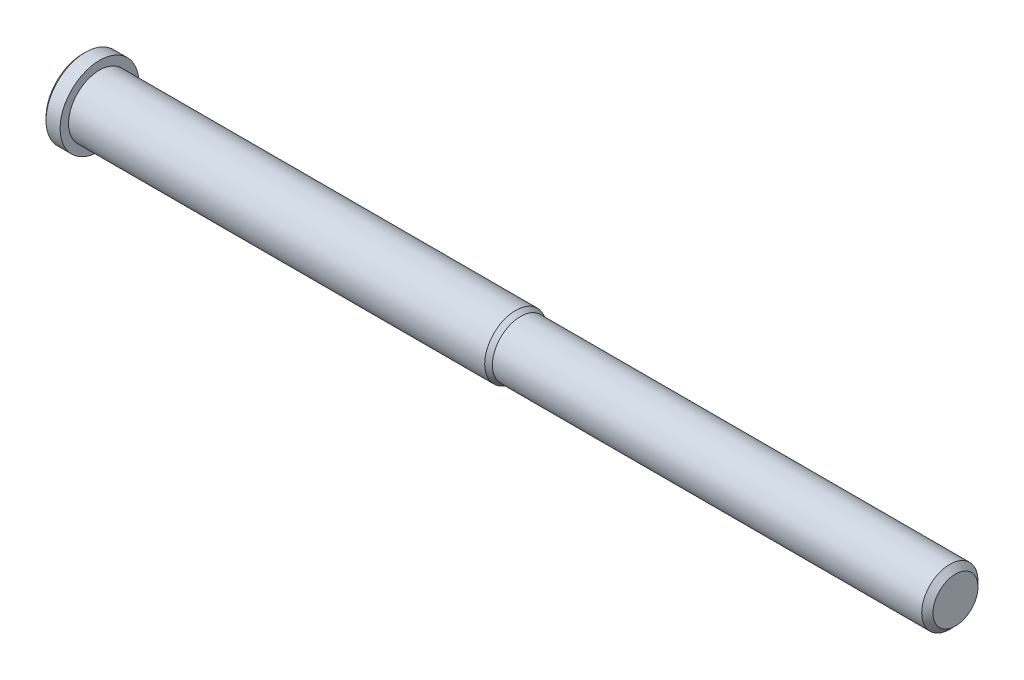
from build123d import *

# Parameters (mm, degrees)
CHANFREIN1_SIZE = 1
CHANFREIN2_SIZE = 2


with BuildPart() as part:
    # Esquisse1 → R_volution1 (revolve)
    with BuildSketch(Plane.XY, mode=Mode.PRIVATE) as r_volution1_sk:
        Polygon((0, 0), (0, 14), (6, 14), (6, 11), (153.801738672, 11), (155.533789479, 10), (310, 10), (310, 0), align=None)
    revolve(r_volution1_sk.sketch.rotate(Axis((0, 0, 0), (1, 0, 0)), 90), axis=Axis((0, 0, 0), (1, 0, 0)))

    # Chanfrein1
    chanfrein1_edges = [part.edges().sort_by_distance(p)[0] for p in [
        (0, 0, -14),
    ]]
    chamfer(chanfrein1_edges, length=CHANFREIN1_SIZE)

    # Chanfrein2
    chanfrein2_edges = [part.edges().sort_by_distance(p)[0] for p in [
        (310, 0, -10),
    ]]
    chamfer(chanfrein2_edges, length=CHANFREIN2_SIZE)


solid = part.part
